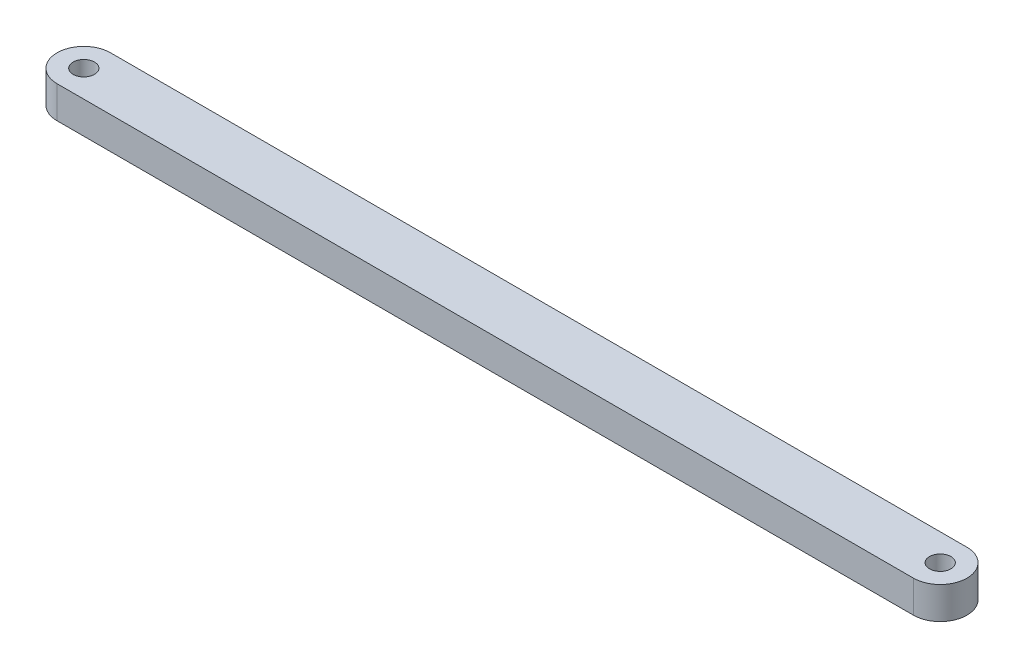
ISO-10303-21;
HEADER;
FILE_DESCRIPTION(('STEP AP214'),'2;1');
FILE_NAME('part.step','',(''),(''),'','','');
FILE_SCHEMA(('AUTOMOTIVE_DESIGN { 1 0 10303 214 1 1 1 1 }'));
ENDSEC;
DATA;
#1=APPLICATION_CONTEXT('core data for automotive mechanical design processes');
#2=APPLICATION_PROTOCOL_DEFINITION('international standard','automotive_design',2000,#1);
#3=PRODUCT_CONTEXT('',#1,'mechanical');
#4=PRODUCT('Part','Part','',(#3));
#5=PRODUCT_RELATED_PRODUCT_CATEGORY('part','',(#4));
#6=PRODUCT_DEFINITION_FORMATION('','',#4);
#7=PRODUCT_DEFINITION_CONTEXT('part definition',#1,'design');
#8=PRODUCT_DEFINITION('design','',#6,#7);
#9=PRODUCT_DEFINITION_SHAPE('','',#8);
#10=(LENGTH_UNIT() NAMED_UNIT(*) SI_UNIT(.MILLI.,.METRE.));
#11=(NAMED_UNIT(*) PLANE_ANGLE_UNIT() SI_UNIT($,.RADIAN.));
#12=(NAMED_UNIT(*) SI_UNIT($,.STERADIAN.) SOLID_ANGLE_UNIT());
#13=UNCERTAINTY_MEASURE_WITH_UNIT(LENGTH_MEASURE(1.E-05),#10,'distance_accuracy_value','');
#14=(GEOMETRIC_REPRESENTATION_CONTEXT(3) GLOBAL_UNCERTAINTY_ASSIGNED_CONTEXT((#13)) GLOBAL_UNIT_ASSIGNED_CONTEXT((#10,
#11,#12)) REPRESENTATION_CONTEXT('',''));
#15=CARTESIAN_POINT('',(0.,0.,0.));
#16=DIRECTION('',(0.,0.,1.));
#17=DIRECTION('',(1.,0.,0.));
#18=AXIS2_PLACEMENT_3D('',#15,#16,#17);
#19=CARTESIAN_POINT('',(-400.,30.,0.));
#20=DIRECTION('',(0.,1.,0.));
#21=DIRECTION('',(0.,0.,1.));
#22=AXIS2_PLACEMENT_3D('',#19,#20,#21);
#23=PLANE('',#22);
#24=CARTESIAN_POINT('',(-400.,30.,0.));
#25=DIRECTION('',(0.,1.,0.));
#26=DIRECTION('',(0.,0.,1.));
#27=AXIS2_PLACEMENT_3D('',#24,#25,#26);
#28=CIRCLE('',#27,9.99999999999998);
#29=CARTESIAN_POINT('',(-400.,30.,9.99999999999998));
#30=VERTEX_POINT('',#29);
#31=EDGE_CURVE('E98',#30,#30,#28,.T.);
#32=ORIENTED_EDGE('',*,*,#31,.F.);
#33=EDGE_LOOP('',(#32));
#34=FACE_BOUND('',#33,.T.);
#35=CARTESIAN_POINT('',(-400.,30.,0.));
#36=DIRECTION('',(0.,1.,0.));
#37=DIRECTION('',(0.,0.,1.));
#38=AXIS2_PLACEMENT_3D('',#35,#36,#37);
#39=CIRCLE('',#38,25.);
#40=CARTESIAN_POINT('',(-400.,30.,-25.));
#41=VERTEX_POINT('',#40);
#42=CARTESIAN_POINT('',(-400.,30.,25.));
#43=VERTEX_POINT('',#42);
#44=EDGE_CURVE('E83',#41,#43,#39,.T.);
#45=ORIENTED_EDGE('',*,*,#44,.T.);
#46=DIRECTION('',(1.,0.,0.));
#47=VECTOR('',#46,1.);
#48=CARTESIAN_POINT('',(-400.,30.,25.));
#49=LINE('',#48,#47);
#50=CARTESIAN_POINT('',(400.,30.,25.));
#51=VERTEX_POINT('',#50);
#52=EDGE_CURVE('E78',#43,#51,#49,.T.);
#53=ORIENTED_EDGE('',*,*,#52,.T.);
#54=CARTESIAN_POINT('',(400.,30.,0.));
#55=DIRECTION('',(0.,1.,0.));
#56=DIRECTION('',(0.,0.,1.));
#57=AXIS2_PLACEMENT_3D('',#54,#55,#56);
#58=CIRCLE('',#57,25.);
#59=CARTESIAN_POINT('',(400.,30.,-25.));
#60=VERTEX_POINT('',#59);
#61=EDGE_CURVE('E81',#51,#60,#58,.T.);
#62=ORIENTED_EDGE('',*,*,#61,.T.);
#63=DIRECTION('',(-1.,0.,0.));
#64=VECTOR('',#63,1.);
#65=CARTESIAN_POINT('',(-400.,30.,-25.));
#66=LINE('',#65,#64);
#67=EDGE_CURVE('E48',#60,#41,#66,.T.);
#68=ORIENTED_EDGE('',*,*,#67,.T.);
#69=EDGE_LOOP('',(#45,#53,#62,#68));
#70=FACE_BOUND('',#69,.T.);
#71=CARTESIAN_POINT('',(400.,30.,0.));
#72=DIRECTION('',(0.,1.,0.));
#73=DIRECTION('',(0.,0.,1.));
#74=AXIS2_PLACEMENT_3D('',#71,#72,#73);
#75=CIRCLE('',#74,9.99999999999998);
#76=CARTESIAN_POINT('',(400.,30.,9.99999999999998));
#77=VERTEX_POINT('',#76);
#78=EDGE_CURVE('E113',#77,#77,#75,.T.);
#79=ORIENTED_EDGE('',*,*,#78,.F.);
#80=EDGE_LOOP('',(#79));
#81=FACE_BOUND('',#80,.T.);
#82=ADVANCED_FACE('F31',(#34,#70,#81),#23,.T.);
#83=CARTESIAN_POINT('',(-400.,0.,0.));
#84=DIRECTION('',(0.,1.,0.));
#85=DIRECTION('',(0.,0.,1.));
#86=AXIS2_PLACEMENT_3D('',#83,#84,#85);
#87=PLANE('',#86);
#88=CARTESIAN_POINT('',(-400.,0.,0.));
#89=DIRECTION('',(0.,1.,0.));
#90=DIRECTION('',(0.,0.,1.));
#91=AXIS2_PLACEMENT_3D('',#88,#89,#90);
#92=CIRCLE('',#91,9.99999999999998);
#93=CARTESIAN_POINT('',(-400.,0.,9.99999999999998));
#94=VERTEX_POINT('',#93);
#95=EDGE_CURVE('E110',#94,#94,#92,.T.);
#96=ORIENTED_EDGE('',*,*,#95,.T.);
#97=EDGE_LOOP('',(#96));
#98=FACE_BOUND('',#97,.T.);
#99=CARTESIAN_POINT('',(-400.,0.,0.));
#100=DIRECTION('',(0.,1.,0.));
#101=DIRECTION('',(0.,0.,1.));
#102=AXIS2_PLACEMENT_3D('',#99,#100,#101);
#103=CIRCLE('',#102,25.);
#104=CARTESIAN_POINT('',(-400.,0.,-25.));
#105=VERTEX_POINT('',#104);
#106=CARTESIAN_POINT('',(-400.,0.,25.));
#107=VERTEX_POINT('',#106);
#108=EDGE_CURVE('E95',#105,#107,#103,.T.);
#109=ORIENTED_EDGE('',*,*,#108,.F.);
#110=DIRECTION('',(-1.,0.,0.));
#111=VECTOR('',#110,1.);
#112=CARTESIAN_POINT('',(-400.,0.,-25.));
#113=LINE('',#112,#111);
#114=CARTESIAN_POINT('',(400.,0.,-25.));
#115=VERTEX_POINT('',#114);
#116=EDGE_CURVE('E71',#115,#105,#113,.T.);
#117=ORIENTED_EDGE('',*,*,#116,.F.);
#118=CARTESIAN_POINT('',(400.,0.,0.));
#119=DIRECTION('',(0.,1.,0.));
#120=DIRECTION('',(0.,0.,1.));
#121=AXIS2_PLACEMENT_3D('',#118,#119,#120);
#122=CIRCLE('',#121,25.);
#123=CARTESIAN_POINT('',(400.,0.,25.));
#124=VERTEX_POINT('',#123);
#125=EDGE_CURVE('E65',#124,#115,#122,.T.);
#126=ORIENTED_EDGE('',*,*,#125,.F.);
#127=DIRECTION('',(1.,0.,0.));
#128=VECTOR('',#127,1.);
#129=CARTESIAN_POINT('',(-400.,0.,25.));
#130=LINE('',#129,#128);
#131=EDGE_CURVE('E87',#107,#124,#130,.T.);
#132=ORIENTED_EDGE('',*,*,#131,.F.);
#133=EDGE_LOOP('',(#109,#117,#126,#132));
#134=FACE_BOUND('',#133,.T.);
#135=CARTESIAN_POINT('',(400.,0.,0.));
#136=DIRECTION('',(0.,1.,0.));
#137=DIRECTION('',(0.,0.,1.));
#138=AXIS2_PLACEMENT_3D('',#135,#136,#137);
#139=CIRCLE('',#138,9.99999999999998);
#140=CARTESIAN_POINT('',(400.,0.,9.99999999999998));
#141=VERTEX_POINT('',#140);
#142=EDGE_CURVE('E116',#141,#141,#139,.T.);
#143=ORIENTED_EDGE('',*,*,#142,.T.);
#144=EDGE_LOOP('',(#143));
#145=FACE_BOUND('',#144,.T.);
#146=ADVANCED_FACE('F106',(#98,#134,#145),#87,.F.);
#147=CARTESIAN_POINT('',(-400.,30.,0.));
#148=DIRECTION('',(0.,-1.,0.));
#149=DIRECTION('',(0.,0.,-1.));
#150=AXIS2_PLACEMENT_3D('',#147,#148,#149);
#151=CYLINDRICAL_SURFACE('',#150,25.);
#152=ORIENTED_EDGE('',*,*,#108,.T.);
#153=DIRECTION('',(0.,-1.,0.));
#154=VECTOR('',#153,1.);
#155=CARTESIAN_POINT('',(-400.,30.,25.));
#156=LINE('',#155,#154);
#157=EDGE_CURVE('E11',#43,#107,#156,.T.);
#158=ORIENTED_EDGE('',*,*,#157,.F.);
#159=ORIENTED_EDGE('',*,*,#44,.F.);
#160=DIRECTION('',(0.,-1.,0.));
#161=VECTOR('',#160,1.);
#162=CARTESIAN_POINT('',(-400.,30.,-25.));
#163=LINE('',#162,#161);
#164=EDGE_CURVE('E91',#41,#105,#163,.T.);
#165=ORIENTED_EDGE('',*,*,#164,.T.);
#166=EDGE_LOOP('',(#152,#158,#159,#165));
#167=FACE_BOUND('',#166,.T.);
#168=ADVANCED_FACE('F33',(#167),#151,.T.);
#169=CARTESIAN_POINT('',(-400.,30.,25.));
#170=DIRECTION('',(0.,0.,-1.));
#171=DIRECTION('',(-1.,0.,0.));
#172=AXIS2_PLACEMENT_3D('',#169,#170,#171);
#173=PLANE('',#172);
#174=ORIENTED_EDGE('',*,*,#131,.T.);
#175=DIRECTION('',(0.,-1.,0.));
#176=VECTOR('',#175,1.);
#177=CARTESIAN_POINT('',(400.,30.,25.));
#178=LINE('',#177,#176);
#179=EDGE_CURVE('E40',#51,#124,#178,.T.);
#180=ORIENTED_EDGE('',*,*,#179,.F.);
#181=ORIENTED_EDGE('',*,*,#52,.F.);
#182=ORIENTED_EDGE('',*,*,#157,.T.);
#183=EDGE_LOOP('',(#174,#180,#181,#182));
#184=FACE_BOUND('',#183,.T.);
#185=ADVANCED_FACE('F86',(#184),#173,.F.);
#186=CARTESIAN_POINT('',(400.,30.,0.));
#187=DIRECTION('',(0.,-1.,0.));
#188=DIRECTION('',(0.,0.,-1.));
#189=AXIS2_PLACEMENT_3D('',#186,#187,#188);
#190=CYLINDRICAL_SURFACE('',#189,25.);
#191=ORIENTED_EDGE('',*,*,#125,.T.);
#192=DIRECTION('',(0.,-1.,0.));
#193=VECTOR('',#192,1.);
#194=CARTESIAN_POINT('',(400.,30.,-25.));
#195=LINE('',#194,#193);
#196=EDGE_CURVE('E88',#60,#115,#195,.T.);
#197=ORIENTED_EDGE('',*,*,#196,.F.);
#198=ORIENTED_EDGE('',*,*,#61,.F.);
#199=ORIENTED_EDGE('',*,*,#179,.T.);
#200=EDGE_LOOP('',(#191,#197,#198,#199));
#201=FACE_BOUND('',#200,.T.);
#202=ADVANCED_FACE('F89',(#201),#190,.T.);
#203=CARTESIAN_POINT('',(-400.,30.,-25.));
#204=DIRECTION('',(0.,0.,1.));
#205=DIRECTION('',(1.,0.,0.));
#206=AXIS2_PLACEMENT_3D('',#203,#204,#205);
#207=PLANE('',#206);
#208=ORIENTED_EDGE('',*,*,#116,.T.);
#209=ORIENTED_EDGE('',*,*,#164,.F.);
#210=ORIENTED_EDGE('',*,*,#67,.F.);
#211=ORIENTED_EDGE('',*,*,#196,.T.);
#212=EDGE_LOOP('',(#208,#209,#210,#211));
#213=FACE_BOUND('',#212,.T.);
#214=ADVANCED_FACE('F103',(#213),#207,.F.);
#215=CARTESIAN_POINT('',(-400.,30.,0.));
#216=DIRECTION('',(0.,-1.,0.));
#217=DIRECTION('',(0.,0.,-1.));
#218=AXIS2_PLACEMENT_3D('',#215,#216,#217);
#219=CYLINDRICAL_SURFACE('',#218,9.99999999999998);
#220=ORIENTED_EDGE('',*,*,#31,.T.);
#221=EDGE_LOOP('',(#220));
#222=FACE_BOUND('',#221,.T.);
#223=ORIENTED_EDGE('',*,*,#95,.F.);
#224=EDGE_LOOP('',(#223));
#225=FACE_BOUND('',#224,.T.);
#226=ADVANCED_FACE('F134',(#222,#225),#219,.F.);
#227=CARTESIAN_POINT('',(400.,30.,0.));
#228=DIRECTION('',(0.,-1.,0.));
#229=DIRECTION('',(0.,0.,-1.));
#230=AXIS2_PLACEMENT_3D('',#227,#228,#229);
#231=CYLINDRICAL_SURFACE('',#230,9.99999999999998);
#232=ORIENTED_EDGE('',*,*,#78,.T.);
#233=EDGE_LOOP('',(#232));
#234=FACE_BOUND('',#233,.T.);
#235=ORIENTED_EDGE('',*,*,#142,.F.);
#236=EDGE_LOOP('',(#235));
#237=FACE_BOUND('',#236,.T.);
#238=ADVANCED_FACE('F122',(#234,#237),#231,.F.);
#239=CLOSED_SHELL('',(#82,#146,#168,#185,#202,#214,#226,#238));
#240=MANIFOLD_SOLID_BREP('B2',#239);
#241=ADVANCED_BREP_SHAPE_REPRESENTATION('',(#18,#240),#14);
#242=SHAPE_DEFINITION_REPRESENTATION(#9,#241);
ENDSEC;
END-ISO-10303-21;
